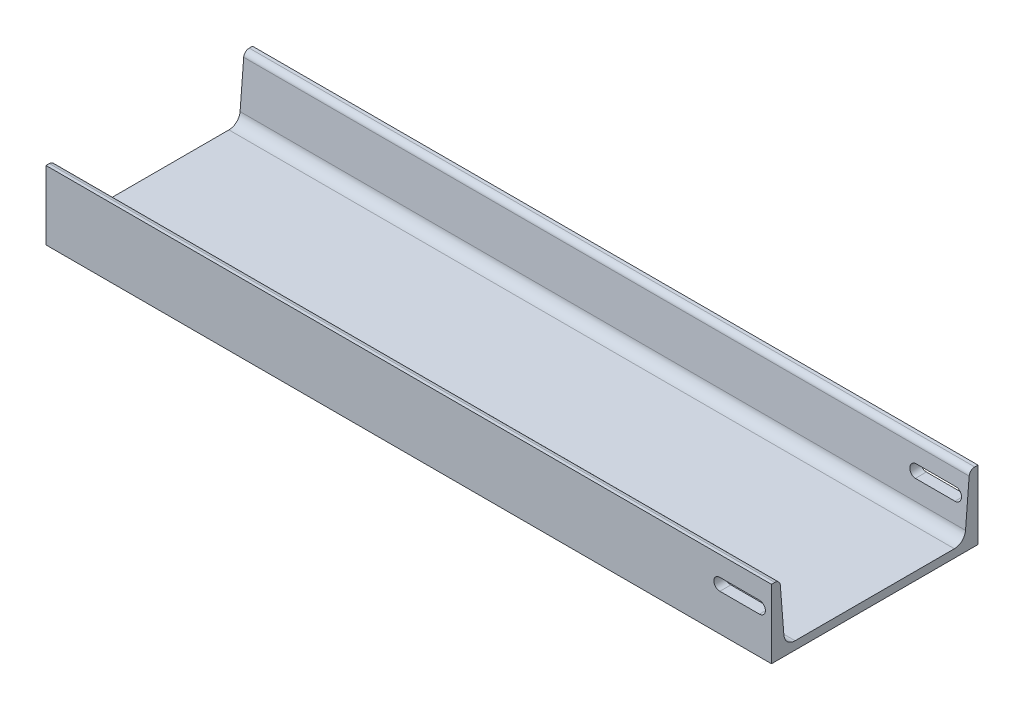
ISO-10303-21;
HEADER;
FILE_DESCRIPTION(('STEP AP214'),'2;1');
FILE_NAME('part.step','',(''),(''),'','','');
FILE_SCHEMA(('AUTOMOTIVE_DESIGN { 1 0 10303 214 1 1 1 1 }'));
ENDSEC;
DATA;
#1=APPLICATION_CONTEXT('core data for automotive mechanical design processes');
#2=APPLICATION_PROTOCOL_DEFINITION('international standard','automotive_design',2000,#1);
#3=PRODUCT_CONTEXT('',#1,'mechanical');
#4=PRODUCT('Part','Part','',(#3));
#5=PRODUCT_RELATED_PRODUCT_CATEGORY('part','',(#4));
#6=PRODUCT_DEFINITION_FORMATION('','',#4);
#7=PRODUCT_DEFINITION_CONTEXT('part definition',#1,'design');
#8=PRODUCT_DEFINITION('design','',#6,#7);
#9=PRODUCT_DEFINITION_SHAPE('','',#8);
#10=(LENGTH_UNIT() NAMED_UNIT(*) SI_UNIT(.MILLI.,.METRE.));
#11=(NAMED_UNIT(*) PLANE_ANGLE_UNIT() SI_UNIT($,.RADIAN.));
#12=(NAMED_UNIT(*) SI_UNIT($,.STERADIAN.) SOLID_ANGLE_UNIT());
#13=UNCERTAINTY_MEASURE_WITH_UNIT(LENGTH_MEASURE(1.E-05),#10,'distance_accuracy_value','');
#14=(GEOMETRIC_REPRESENTATION_CONTEXT(3) GLOBAL_UNCERTAINTY_ASSIGNED_CONTEXT((#13)) GLOBAL_UNIT_ASSIGNED_CONTEXT((#10,
#11,#12)) REPRESENTATION_CONTEXT('',''));
#15=CARTESIAN_POINT('',(0.,0.,0.));
#16=DIRECTION('',(0.,0.,1.));
#17=DIRECTION('',(1.,0.,0.));
#18=AXIS2_PLACEMENT_3D('',#15,#16,#17);
#19=CARTESIAN_POINT('',(842.999999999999,-2.22044604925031E-13,-119.999999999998));
#20=DIRECTION('',(0.,0.,1.));
#21=DIRECTION('',(0.,-1.,0.));
#22=AXIS2_PLACEMENT_3D('',#19,#20,#21);
#23=PLANE('',#22);
#24=DIRECTION('',(-1.,0.,0.));
#25=VECTOR('',#24,1.);
#26=CARTESIAN_POINT('',(782.999999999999,57.,-119.999999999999));
#27=LINE('',#26,#25);
#28=CARTESIAN_POINT('',(829.,57.0000000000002,-119.999999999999));
#29=VERTEX_POINT('',#28);
#30=CARTESIAN_POINT('',(782.999999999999,57.,-119.999999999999));
#31=VERTEX_POINT('',#30);
#32=EDGE_CURVE('E205',#29,#31,#27,.T.);
#33=ORIENTED_EDGE('',*,*,#32,.T.);
#34=CARTESIAN_POINT('',(782.999999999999,49.9999999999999,-119.999999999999));
#35=DIRECTION('',(0.,0.,1.));
#36=DIRECTION('',(1.,0.,0.));
#37=AXIS2_PLACEMENT_3D('',#34,#35,#36);
#38=CIRCLE('',#37,7.00000000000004);
#39=CARTESIAN_POINT('',(783.,42.9999999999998,-119.999999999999));
#40=VERTEX_POINT('',#39);
#41=EDGE_CURVE('E195',#31,#40,#38,.T.);
#42=ORIENTED_EDGE('',*,*,#41,.T.);
#43=DIRECTION('',(1.,0.,0.));
#44=VECTOR('',#43,1.);
#45=CARTESIAN_POINT('',(783.,42.9999999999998,-119.999999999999));
#46=LINE('',#45,#44);
#47=CARTESIAN_POINT('',(828.999999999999,42.9999999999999,-119.999999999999));
#48=VERTEX_POINT('',#47);
#49=EDGE_CURVE('E201',#40,#48,#46,.T.);
#50=ORIENTED_EDGE('',*,*,#49,.T.);
#51=CARTESIAN_POINT('',(829.,50.,-119.999999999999));
#52=DIRECTION('',(0.,0.,1.));
#53=DIRECTION('',(1.,0.,0.));
#54=AXIS2_PLACEMENT_3D('',#51,#52,#53);
#55=CIRCLE('',#54,7.00000000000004);
#56=EDGE_CURVE('E44',#48,#29,#55,.T.);
#57=ORIENTED_EDGE('',*,*,#56,.T.);
#58=EDGE_LOOP('',(#33,#42,#50,#57));
#59=FACE_BOUND('',#58,.T.);
#60=DIRECTION('',(0.,1.,0.));
#61=VECTOR('',#60,1.);
#62=CARTESIAN_POINT('',(-2.22044604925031E-13,-3.33066907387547E-13,-120.));
#63=LINE('',#62,#61);
#64=CARTESIAN_POINT('',(-2.22044604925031E-13,-3.33066907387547E-13,-120.));
#65=VERTEX_POINT('',#64);
#66=CARTESIAN_POINT('',(-4.44089209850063E-13,79.9999999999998,-120.));
#67=VERTEX_POINT('',#66);
#68=EDGE_CURVE('E238',#65,#67,#63,.T.);
#69=ORIENTED_EDGE('',*,*,#68,.T.);
#70=DIRECTION('',(-1.,0.,0.));
#71=VECTOR('',#70,1.);
#72=CARTESIAN_POINT('',(842.999999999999,79.9999999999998,-119.999999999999));
#73=LINE('',#72,#71);
#74=CARTESIAN_POINT('',(842.999999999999,79.9999999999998,-119.999999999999));
#75=VERTEX_POINT('',#74);
#76=EDGE_CURVE('E11',#75,#67,#73,.T.);
#77=ORIENTED_EDGE('',*,*,#76,.F.);
#78=DIRECTION('',(0.,1.,0.));
#79=VECTOR('',#78,1.);
#80=CARTESIAN_POINT('',(842.999999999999,-2.22044604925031E-13,-119.999999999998));
#81=LINE('',#80,#79);
#82=CARTESIAN_POINT('',(842.999999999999,-2.22044604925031E-13,-119.999999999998));
#83=VERTEX_POINT('',#82);
#84=EDGE_CURVE('E263',#83,#75,#81,.T.);
#85=ORIENTED_EDGE('',*,*,#84,.F.);
#86=DIRECTION('',(-1.,0.,0.));
#87=VECTOR('',#86,1.);
#88=CARTESIAN_POINT('',(842.999999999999,-2.22044604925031E-13,-119.999999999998));
#89=LINE('',#88,#87);
#90=EDGE_CURVE('E288',#83,#65,#89,.T.);
#91=ORIENTED_EDGE('',*,*,#90,.T.);
#92=EDGE_LOOP('',(#69,#77,#85,#91));
#93=FACE_BOUND('',#92,.T.);
#94=ADVANCED_FACE('F30',(#59,#93),#23,.F.);
#95=CARTESIAN_POINT('',(842.999999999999,79.9999999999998,-119.999999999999));
#96=DIRECTION('',(0.,-1.,0.));
#97=DIRECTION('',(0.,0.,-1.));
#98=AXIS2_PLACEMENT_3D('',#95,#96,#97);
#99=PLANE('',#98);
#100=DIRECTION('',(0.,0.,0.999999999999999));
#101=VECTOR('',#100,1.);
#102=CARTESIAN_POINT('',(-4.44089209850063E-13,79.9999999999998,-120.));
#103=LINE('',#102,#101);
#104=CARTESIAN_POINT('',(-4.44089209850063E-13,79.9999999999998,-116.198423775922));
#105=VERTEX_POINT('',#104);
#106=EDGE_CURVE('E241',#67,#105,#103,.T.);
#107=ORIENTED_EDGE('',*,*,#106,.T.);
#108=DIRECTION('',(-1.,0.,0.));
#109=VECTOR('',#108,1.);
#110=CARTESIAN_POINT('',(842.999999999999,80.,-116.198423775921));
#111=LINE('',#110,#109);
#112=CARTESIAN_POINT('',(842.999999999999,80.,-116.198423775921));
#113=VERTEX_POINT('',#112);
#114=EDGE_CURVE('E37',#113,#105,#111,.T.);
#115=ORIENTED_EDGE('',*,*,#114,.F.);
#116=DIRECTION('',(0.,0.,0.999999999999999));
#117=VECTOR('',#116,1.);
#118=CARTESIAN_POINT('',(842.999999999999,79.9999999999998,-119.999999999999));
#119=LINE('',#118,#117);
#120=EDGE_CURVE('E266',#75,#113,#119,.T.);
#121=ORIENTED_EDGE('',*,*,#120,.F.);
#122=ORIENTED_EDGE('',*,*,#76,.T.);
#123=EDGE_LOOP('',(#107,#115,#121,#122));
#124=FACE_BOUND('',#123,.T.);
#125=ADVANCED_FACE('F345',(#124),#99,.F.);
#126=CARTESIAN_POINT('',(843.,73.5000000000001,-116.198423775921));
#127=DIRECTION('',(-1.,0.,0.));
#128=DIRECTION('',(0.,0.,1.));
#129=AXIS2_PLACEMENT_3D('',#126,#127,#128);
#130=CYLINDRICAL_SURFACE('',#129,6.50000000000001);
#131=CARTESIAN_POINT('',(-2.22044604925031E-13,73.4999999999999,-116.198423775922));
#132=DIRECTION('',(1.,0.,0.));
#133=DIRECTION('',(0.,0.,-1.));
#134=AXIS2_PLACEMENT_3D('',#131,#132,#133);
#135=CIRCLE('',#134,6.50000000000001);
#136=CARTESIAN_POINT('',(-2.22044604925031E-13,74.0179005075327,-109.719089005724));
#137=VERTEX_POINT('',#136);
#138=EDGE_CURVE('E243',#105,#137,#135,.T.);
#139=ORIENTED_EDGE('',*,*,#138,.T.);
#140=DIRECTION('',(-1.,0.,0.));
#141=VECTOR('',#140,1.);
#142=CARTESIAN_POINT('',(843.,74.017900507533,-109.719089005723));
#143=LINE('',#142,#141);
#144=CARTESIAN_POINT('',(843.,74.017900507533,-109.719089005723));
#145=VERTEX_POINT('',#144);
#146=EDGE_CURVE('E315',#145,#137,#143,.T.);
#147=ORIENTED_EDGE('',*,*,#146,.F.);
#148=CARTESIAN_POINT('',(843.,73.5000000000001,-116.198423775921));
#149=DIRECTION('',(1.,0.,0.));
#150=DIRECTION('',(0.,0.,-1.));
#151=AXIS2_PLACEMENT_3D('',#148,#149,#150);
#152=CIRCLE('',#151,6.50000000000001);
#153=EDGE_CURVE('E268',#113,#145,#152,.T.);
#154=ORIENTED_EDGE('',*,*,#153,.F.);
#155=ORIENTED_EDGE('',*,*,#114,.T.);
#156=EDGE_LOOP('',(#139,#147,#154,#155));
#157=FACE_BOUND('',#156,.T.);
#158=ADVANCED_FACE('F322',(#157),#130,.T.);
#159=CARTESIAN_POINT('',(843.,74.017900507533,-109.719089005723));
#160=DIRECTION('',(0.,-0.0796770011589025,-0.99682073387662));
#161=DIRECTION('',(0.,0.99682073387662,-0.079677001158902));
#162=AXIS2_PLACEMENT_3D('',#159,#160,#161);
#163=PLANE('',#162);
#164=DIRECTION('',(-1.,0.,0.));
#165=VECTOR('',#164,1.);
#166=CARTESIAN_POINT('',(843.,42.9999999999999,-107.239793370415));
#167=LINE('',#166,#165);
#168=CARTESIAN_POINT('',(829.,42.9999999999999,-107.239793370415));
#169=VERTEX_POINT('',#168);
#170=CARTESIAN_POINT('',(783.,42.9999999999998,-107.239793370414));
#171=VERTEX_POINT('',#170);
#172=EDGE_CURVE('E219',#169,#171,#167,.T.);
#173=ORIENTED_EDGE('',*,*,#172,.T.);
#174=CARTESIAN_POINT('',(783.,50.0000000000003,-107.799311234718));
#175=DIRECTION('',(0.,-0.0796770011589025,-0.99682073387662));
#176=DIRECTION('',(0.,-0.99682073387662,0.079677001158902));
#177=AXIS2_PLACEMENT_3D('',#174,#175,#176);
#178=ELLIPSE('',#177,7.02232584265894,7.00000000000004);
#179=CARTESIAN_POINT('',(783.,56.9999999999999,-108.358829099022));
#180=VERTEX_POINT('',#179);
#181=EDGE_CURVE('E235',#171,#180,#178,.T.);
#182=ORIENTED_EDGE('',*,*,#181,.T.);
#183=DIRECTION('',(1.,0.,0.));
#184=VECTOR('',#183,1.);
#185=CARTESIAN_POINT('',(843.,57.,-108.358829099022));
#186=LINE('',#185,#184);
#187=CARTESIAN_POINT('',(829.,57.,-108.358829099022));
#188=VERTEX_POINT('',#187);
#189=EDGE_CURVE('E229',#180,#188,#186,.T.);
#190=ORIENTED_EDGE('',*,*,#189,.T.);
#191=CARTESIAN_POINT('',(829.,49.9999999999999,-107.799311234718));
#192=DIRECTION('',(0.,-0.0796770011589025,-0.99682073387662));
#193=DIRECTION('',(0.,-0.99682073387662,0.079677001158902));
#194=AXIS2_PLACEMENT_3D('',#191,#192,#193);
#195=ELLIPSE('',#194,7.02232584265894,7.00000000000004);
#196=EDGE_CURVE('E223',#188,#169,#195,.T.);
#197=ORIENTED_EDGE('',*,*,#196,.T.);
#198=EDGE_LOOP('',(#173,#182,#190,#197));
#199=FACE_BOUND('',#198,.T.);
#200=DIRECTION('',(0.,-0.99682073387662,0.0796770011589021));
#201=VECTOR('',#200,1.);
#202=CARTESIAN_POINT('',(-2.22044604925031E-13,74.0179005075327,-109.719089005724));
#203=LINE('',#202,#201);
#204=CARTESIAN_POINT('',(-2.22044604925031E-13,21.464198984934,-105.518412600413));
#205=VERTEX_POINT('',#204);
#206=EDGE_CURVE('E245',#137,#205,#203,.T.);
#207=ORIENTED_EDGE('',*,*,#206,.T.);
#208=DIRECTION('',(-1.,0.,0.));
#209=VECTOR('',#208,1.);
#210=CARTESIAN_POINT('',(843.,21.4641989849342,-105.518412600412));
#211=LINE('',#210,#209);
#212=CARTESIAN_POINT('',(843.,21.4641989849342,-105.518412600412));
#213=VERTEX_POINT('',#212);
#214=EDGE_CURVE('E312',#213,#205,#211,.T.);
#215=ORIENTED_EDGE('',*,*,#214,.F.);
#216=DIRECTION('',(0.,-0.99682073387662,0.0796770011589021));
#217=VECTOR('',#216,1.);
#218=CARTESIAN_POINT('',(843.,74.017900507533,-109.719089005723));
#219=LINE('',#218,#217);
#220=EDGE_CURVE('E270',#145,#213,#219,.T.);
#221=ORIENTED_EDGE('',*,*,#220,.F.);
#222=ORIENTED_EDGE('',*,*,#146,.T.);
#223=EDGE_LOOP('',(#207,#215,#221,#222));
#224=FACE_BOUND('',#223,.T.);
#225=ADVANCED_FACE('F333',(#199,#224),#163,.F.);
#226=CARTESIAN_POINT('',(843.,22.5000000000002,-92.5597430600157));
#227=DIRECTION('',(-1.,0.,0.));
#228=DIRECTION('',(0.,0.,1.));
#229=AXIS2_PLACEMENT_3D('',#226,#227,#228);
#230=CYLINDRICAL_SURFACE('',#229,13.);
#231=CARTESIAN_POINT('',(-3.33066907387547E-13,22.5,-92.5597430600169));
#232=DIRECTION('',(-1.,0.,0.));
#233=DIRECTION('',(0.,0.,1.));
#234=AXIS2_PLACEMENT_3D('',#231,#232,#233);
#235=CIRCLE('',#234,13.);
#236=CARTESIAN_POINT('',(-2.22044604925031E-13,9.49999999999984,-92.559743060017));
#237=VERTEX_POINT('',#236);
#238=EDGE_CURVE('E247',#205,#237,#235,.T.);
#239=ORIENTED_EDGE('',*,*,#238,.T.);
#240=DIRECTION('',(-1.,0.,0.));
#241=VECTOR('',#240,1.);
#242=CARTESIAN_POINT('',(843.,9.50000000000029,-92.5597430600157));
#243=LINE('',#242,#241);
#244=CARTESIAN_POINT('',(843.,9.50000000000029,-92.5597430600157));
#245=VERTEX_POINT('',#244);
#246=EDGE_CURVE('E309',#245,#237,#243,.T.);
#247=ORIENTED_EDGE('',*,*,#246,.F.);
#248=CARTESIAN_POINT('',(843.,22.5000000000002,-92.5597430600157));
#249=DIRECTION('',(-1.,0.,0.));
#250=DIRECTION('',(0.,0.,1.));
#251=AXIS2_PLACEMENT_3D('',#248,#249,#250);
#252=CIRCLE('',#251,13.);
#253=EDGE_CURVE('E272',#213,#245,#252,.T.);
#254=ORIENTED_EDGE('',*,*,#253,.F.);
#255=ORIENTED_EDGE('',*,*,#214,.T.);
#256=EDGE_LOOP('',(#239,#247,#254,#255));
#257=FACE_BOUND('',#256,.T.);
#258=ADVANCED_FACE('F337',(#257),#230,.F.);
#259=CARTESIAN_POINT('',(843.,9.50000000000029,-92.5597430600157));
#260=DIRECTION('',(0.,-1.,0.));
#261=DIRECTION('',(0.,0.,-1.));
#262=AXIS2_PLACEMENT_3D('',#259,#260,#261);
#263=PLANE('',#262);
#264=DIRECTION('',(0.,0.,1.));
#265=VECTOR('',#264,1.);
#266=CARTESIAN_POINT('',(-2.22044604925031E-13,9.49999999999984,-92.559743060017));
#267=LINE('',#266,#265);
#268=CARTESIAN_POINT('',(2.22044604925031E-13,9.50000000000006,92.559743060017));
#269=VERTEX_POINT('',#268);
#270=EDGE_CURVE('E249',#237,#269,#267,.T.);
#271=ORIENTED_EDGE('',*,*,#270,.T.);
#272=DIRECTION('',(-1.,0.,0.));
#273=VECTOR('',#272,1.);
#274=CARTESIAN_POINT('',(843.,9.5000000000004,92.5597430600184));
#275=LINE('',#274,#273);
#276=CARTESIAN_POINT('',(843.,9.5000000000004,92.5597430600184));
#277=VERTEX_POINT('',#276);
#278=EDGE_CURVE('E306',#277,#269,#275,.T.);
#279=ORIENTED_EDGE('',*,*,#278,.F.);
#280=DIRECTION('',(0.,0.,1.));
#281=VECTOR('',#280,1.);
#282=CARTESIAN_POINT('',(843.,9.50000000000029,-92.5597430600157));
#283=LINE('',#282,#281);
#284=EDGE_CURVE('E274',#245,#277,#283,.T.);
#285=ORIENTED_EDGE('',*,*,#284,.F.);
#286=ORIENTED_EDGE('',*,*,#246,.T.);
#287=EDGE_LOOP('',(#271,#279,#285,#286));
#288=FACE_BOUND('',#287,.T.);
#289=ADVANCED_FACE('F376',(#288),#263,.F.);
#290=CARTESIAN_POINT('',(843.,22.5000000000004,92.5597430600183));
#291=DIRECTION('',(-1.,0.,0.));
#292=DIRECTION('',(0.,0.,1.));
#293=AXIS2_PLACEMENT_3D('',#290,#291,#292);
#294=CYLINDRICAL_SURFACE('',#293,13.);
#295=CARTESIAN_POINT('',(2.22044604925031E-13,22.5000000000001,92.5597430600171));
#296=DIRECTION('',(-1.,0.,0.));
#297=DIRECTION('',(0.,0.,-1.));
#298=AXIS2_PLACEMENT_3D('',#295,#296,#297);
#299=CIRCLE('',#298,13.);
#300=CARTESIAN_POINT('',(2.22044604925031E-13,21.4641989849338,105.518412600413));
#301=VERTEX_POINT('',#300);
#302=EDGE_CURVE('E251',#269,#301,#299,.T.);
#303=ORIENTED_EDGE('',*,*,#302,.T.);
#304=DIRECTION('',(-1.,0.,0.));
#305=VECTOR('',#304,1.);
#306=CARTESIAN_POINT('',(843.,21.4641989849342,105.518412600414));
#307=LINE('',#306,#305);
#308=CARTESIAN_POINT('',(843.,21.4641989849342,105.518412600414));
#309=VERTEX_POINT('',#308);
#310=EDGE_CURVE('E303',#309,#301,#307,.T.);
#311=ORIENTED_EDGE('',*,*,#310,.F.);
#312=CARTESIAN_POINT('',(843.,22.5000000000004,92.5597430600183));
#313=DIRECTION('',(-1.,0.,0.));
#314=DIRECTION('',(0.,0.,-1.));
#315=AXIS2_PLACEMENT_3D('',#312,#313,#314);
#316=CIRCLE('',#315,13.);
#317=EDGE_CURVE('E276',#277,#309,#316,.T.);
#318=ORIENTED_EDGE('',*,*,#317,.F.);
#319=ORIENTED_EDGE('',*,*,#278,.T.);
#320=EDGE_LOOP('',(#303,#311,#318,#319));
#321=FACE_BOUND('',#320,.T.);
#322=ADVANCED_FACE('F374',(#321),#294,.F.);
#323=CARTESIAN_POINT('',(843.,74.0179005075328,109.719089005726));
#324=DIRECTION('',(0.,-0.0796770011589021,0.99682073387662));
#325=DIRECTION('',(0.,-0.99682073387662,-0.0796770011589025));
#326=AXIS2_PLACEMENT_3D('',#323,#324,#325);
#327=PLANE('',#326);
#328=DIRECTION('',(-1.,0.,0.));
#329=VECTOR('',#328,1.);
#330=CARTESIAN_POINT('',(843.,57.,108.358829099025));
#331=LINE('',#330,#329);
#332=CARTESIAN_POINT('',(829.,56.9999999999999,108.358829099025));
#333=VERTEX_POINT('',#332);
#334=CARTESIAN_POINT('',(783.,56.9999999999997,108.358829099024));
#335=VERTEX_POINT('',#334);
#336=EDGE_CURVE('E226',#333,#335,#331,.T.);
#337=ORIENTED_EDGE('',*,*,#336,.T.);
#338=CARTESIAN_POINT('',(783.,50.,107.799311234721));
#339=DIRECTION('',(0.,-0.0796770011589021,0.99682073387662));
#340=DIRECTION('',(0.,0.99682073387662,0.0796770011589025));
#341=AXIS2_PLACEMENT_3D('',#338,#339,#340);
#342=ELLIPSE('',#341,7.02232584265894,7.00000000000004);
#343=CARTESIAN_POINT('',(783.,42.9999999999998,107.239793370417));
#344=VERTEX_POINT('',#343);
#345=EDGE_CURVE('E232',#335,#344,#342,.T.);
#346=ORIENTED_EDGE('',*,*,#345,.T.);
#347=DIRECTION('',(1.,0.,0.));
#348=VECTOR('',#347,1.);
#349=CARTESIAN_POINT('',(843.,43.,107.239793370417));
#350=LINE('',#349,#348);
#351=CARTESIAN_POINT('',(829.,42.9999999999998,107.239793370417));
#352=VERTEX_POINT('',#351);
#353=EDGE_CURVE('E211',#344,#352,#350,.T.);
#354=ORIENTED_EDGE('',*,*,#353,.T.);
#355=CARTESIAN_POINT('',(829.,49.9999999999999,107.799311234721));
#356=DIRECTION('',(0.,-0.0796770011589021,0.99682073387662));
#357=DIRECTION('',(0.,0.99682073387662,0.0796770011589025));
#358=AXIS2_PLACEMENT_3D('',#355,#356,#357);
#359=ELLIPSE('',#358,7.02232584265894,7.00000000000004);
#360=EDGE_CURVE('E175',#352,#333,#359,.T.);
#361=ORIENTED_EDGE('',*,*,#360,.T.);
#362=EDGE_LOOP('',(#337,#346,#354,#361));
#363=FACE_BOUND('',#362,.T.);
#364=DIRECTION('',(0.,0.99682073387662,0.0796770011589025));
#365=VECTOR('',#364,1.);
#366=CARTESIAN_POINT('',(3.33066907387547E-13,74.0179005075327,109.719089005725));
#367=LINE('',#366,#365);
#368=CARTESIAN_POINT('',(3.33066907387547E-13,74.0179005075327,109.719089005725));
#369=VERTEX_POINT('',#368);
#370=EDGE_CURVE('E253',#301,#369,#367,.T.);
#371=ORIENTED_EDGE('',*,*,#370,.T.);
#372=DIRECTION('',(-1.,0.,0.));
#373=VECTOR('',#372,1.);
#374=CARTESIAN_POINT('',(843.,74.0179005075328,109.719089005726));
#375=LINE('',#374,#373);
#376=CARTESIAN_POINT('',(843.,74.0179005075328,109.719089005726));
#377=VERTEX_POINT('',#376);
#378=EDGE_CURVE('E300',#377,#369,#375,.T.);
#379=ORIENTED_EDGE('',*,*,#378,.F.);
#380=DIRECTION('',(0.,0.99682073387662,0.0796770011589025));
#381=VECTOR('',#380,1.);
#382=CARTESIAN_POINT('',(843.,74.0179005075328,109.719089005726));
#383=LINE('',#382,#381);
#384=EDGE_CURVE('E278',#309,#377,#383,.T.);
#385=ORIENTED_EDGE('',*,*,#384,.F.);
#386=ORIENTED_EDGE('',*,*,#310,.T.);
#387=EDGE_LOOP('',(#371,#379,#385,#386));
#388=FACE_BOUND('',#387,.T.);
#389=ADVANCED_FACE('F370',(#363,#388),#327,.F.);
#390=CARTESIAN_POINT('',(843.,73.5000000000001,116.198423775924));
#391=DIRECTION('',(-1.,0.,0.));
#392=DIRECTION('',(0.,0.,1.));
#393=AXIS2_PLACEMENT_3D('',#390,#391,#392);
#394=CYLINDRICAL_SURFACE('',#393,6.50000000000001);
#395=CARTESIAN_POINT('',(3.33066907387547E-13,73.4999999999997,116.198423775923));
#396=DIRECTION('',(1.,0.,0.));
#397=DIRECTION('',(0.,0.,1.));
#398=AXIS2_PLACEMENT_3D('',#395,#396,#397);
#399=CIRCLE('',#398,6.50000000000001);
#400=CARTESIAN_POINT('',(2.22044604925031E-13,79.9999999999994,116.198423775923));
#401=VERTEX_POINT('',#400);
#402=EDGE_CURVE('E255',#369,#401,#399,.T.);
#403=ORIENTED_EDGE('',*,*,#402,.T.);
#404=DIRECTION('',(-1.,0.,0.));
#405=VECTOR('',#404,1.);
#406=CARTESIAN_POINT('',(843.,80.0000000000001,116.198423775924));
#407=LINE('',#406,#405);
#408=CARTESIAN_POINT('',(843.,80.0000000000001,116.198423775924));
#409=VERTEX_POINT('',#408);
#410=EDGE_CURVE('E297',#409,#401,#407,.T.);
#411=ORIENTED_EDGE('',*,*,#410,.F.);
#412=CARTESIAN_POINT('',(843.,73.5000000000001,116.198423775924));
#413=DIRECTION('',(1.,0.,0.));
#414=DIRECTION('',(0.,0.,1.));
#415=AXIS2_PLACEMENT_3D('',#412,#413,#414);
#416=CIRCLE('',#415,6.50000000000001);
#417=EDGE_CURVE('E280',#377,#409,#416,.T.);
#418=ORIENTED_EDGE('',*,*,#417,.F.);
#419=ORIENTED_EDGE('',*,*,#378,.T.);
#420=EDGE_LOOP('',(#403,#411,#418,#419));
#421=FACE_BOUND('',#420,.T.);
#422=ADVANCED_FACE('F365',(#421),#394,.T.);
#423=CARTESIAN_POINT('',(843.,80.,120.000000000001));
#424=DIRECTION('',(0.,-1.,0.));
#425=DIRECTION('',(0.,0.,-1.));
#426=AXIS2_PLACEMENT_3D('',#423,#424,#425);
#427=PLANE('',#426);
#428=DIRECTION('',(0.,0.,0.999999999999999));
#429=VECTOR('',#428,1.);
#430=CARTESIAN_POINT('',(2.22044604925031E-13,79.9999999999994,120.));
#431=LINE('',#430,#429);
#432=CARTESIAN_POINT('',(2.22044604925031E-13,79.9999999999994,120.));
#433=VERTEX_POINT('',#432);
#434=EDGE_CURVE('E257',#401,#433,#431,.T.);
#435=ORIENTED_EDGE('',*,*,#434,.T.);
#436=DIRECTION('',(-1.,0.,0.));
#437=VECTOR('',#436,1.);
#438=CARTESIAN_POINT('',(843.,80.,120.000000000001));
#439=LINE('',#438,#437);
#440=CARTESIAN_POINT('',(843.,80.,120.000000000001));
#441=VERTEX_POINT('',#440);
#442=EDGE_CURVE('E294',#441,#433,#439,.T.);
#443=ORIENTED_EDGE('',*,*,#442,.F.);
#444=DIRECTION('',(0.,0.,0.999999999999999));
#445=VECTOR('',#444,1.);
#446=CARTESIAN_POINT('',(843.,80.,120.000000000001));
#447=LINE('',#446,#445);
#448=EDGE_CURVE('E282',#409,#441,#447,.T.);
#449=ORIENTED_EDGE('',*,*,#448,.F.);
#450=ORIENTED_EDGE('',*,*,#410,.T.);
#451=EDGE_LOOP('',(#435,#443,#449,#450));
#452=FACE_BOUND('',#451,.T.);
#453=ADVANCED_FACE('F359',(#452),#427,.F.);
#454=CARTESIAN_POINT('',(843.,0.,120.000000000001));
#455=DIRECTION('',(0.,0.,-1.));
#456=DIRECTION('',(0.,1.,0.));
#457=AXIS2_PLACEMENT_3D('',#454,#455,#456);
#458=PLANE('',#457);
#459=DIRECTION('',(1.,0.,0.));
#460=VECTOR('',#459,1.);
#461=CARTESIAN_POINT('',(783.,42.9999999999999,120.000000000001));
#462=LINE('',#461,#460);
#463=CARTESIAN_POINT('',(783.,42.9999999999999,120.000000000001));
#464=VERTEX_POINT('',#463);
#465=CARTESIAN_POINT('',(829.,42.9999999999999,120.000000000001));
#466=VERTEX_POINT('',#465);
#467=EDGE_CURVE('E182',#464,#466,#462,.T.);
#468=ORIENTED_EDGE('',*,*,#467,.F.);
#469=CARTESIAN_POINT('',(783.,49.9999999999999,120.000000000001));
#470=DIRECTION('',(0.,0.,1.));
#471=DIRECTION('',(1.,0.,0.));
#472=AXIS2_PLACEMENT_3D('',#469,#470,#471);
#473=CIRCLE('',#472,7.00000000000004);
#474=CARTESIAN_POINT('',(783.,57.0000000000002,120.000000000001));
#475=VERTEX_POINT('',#474);
#476=EDGE_CURVE('E188',#475,#464,#473,.T.);
#477=ORIENTED_EDGE('',*,*,#476,.F.);
#478=DIRECTION('',(-1.,0.,0.));
#479=VECTOR('',#478,1.);
#480=CARTESIAN_POINT('',(783.,57.0000000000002,120.000000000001));
#481=LINE('',#480,#479);
#482=CARTESIAN_POINT('',(829.,57.,120.000000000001));
#483=VERTEX_POINT('',#482);
#484=EDGE_CURVE('E193',#483,#475,#481,.T.);
#485=ORIENTED_EDGE('',*,*,#484,.F.);
#486=CARTESIAN_POINT('',(829.,50.,120.000000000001));
#487=DIRECTION('',(0.,0.,1.));
#488=DIRECTION('',(1.,0.,0.));
#489=AXIS2_PLACEMENT_3D('',#486,#487,#488);
#490=CIRCLE('',#489,7.00000000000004);
#491=EDGE_CURVE('E172',#466,#483,#490,.T.);
#492=ORIENTED_EDGE('',*,*,#491,.F.);
#493=EDGE_LOOP('',(#468,#477,#485,#492));
#494=FACE_BOUND('',#493,.T.);
#495=DIRECTION('',(0.,-1.,0.));
#496=VECTOR('',#495,1.);
#497=CARTESIAN_POINT('',(1.11022302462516E-13,-5.55111512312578E-13,120.));
#498=LINE('',#497,#496);
#499=CARTESIAN_POINT('',(1.11022302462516E-13,-5.55111512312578E-13,120.));
#500=VERTEX_POINT('',#499);
#501=EDGE_CURVE('E259',#433,#500,#498,.T.);
#502=ORIENTED_EDGE('',*,*,#501,.T.);
#503=DIRECTION('',(-1.,0.,0.));
#504=VECTOR('',#503,1.);
#505=CARTESIAN_POINT('',(843.,0.,120.000000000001));
#506=LINE('',#505,#504);
#507=CARTESIAN_POINT('',(843.,0.,120.000000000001));
#508=VERTEX_POINT('',#507);
#509=EDGE_CURVE('E291',#508,#500,#506,.T.);
#510=ORIENTED_EDGE('',*,*,#509,.F.);
#511=DIRECTION('',(0.,-1.,0.));
#512=VECTOR('',#511,1.);
#513=CARTESIAN_POINT('',(843.,0.,120.000000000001));
#514=LINE('',#513,#512);
#515=EDGE_CURVE('E284',#441,#508,#514,.T.);
#516=ORIENTED_EDGE('',*,*,#515,.F.);
#517=ORIENTED_EDGE('',*,*,#442,.T.);
#518=EDGE_LOOP('',(#502,#510,#516,#517));
#519=FACE_BOUND('',#518,.T.);
#520=ADVANCED_FACE('F190',(#494,#519),#458,.F.);
#521=CARTESIAN_POINT('',(843.,0.,120.000000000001));
#522=DIRECTION('',(0.,1.,0.));
#523=DIRECTION('',(0.,0.,1.));
#524=AXIS2_PLACEMENT_3D('',#521,#522,#523);
#525=PLANE('',#524);
#526=DIRECTION('',(0.,0.,-1.));
#527=VECTOR('',#526,1.);
#528=CARTESIAN_POINT('',(1.11022302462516E-13,-5.55111512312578E-13,120.));
#529=LINE('',#528,#527);
#530=EDGE_CURVE('E261',#500,#65,#529,.T.);
#531=ORIENTED_EDGE('',*,*,#530,.T.);
#532=ORIENTED_EDGE('',*,*,#90,.F.);
#533=DIRECTION('',(0.,0.,-1.));
#534=VECTOR('',#533,1.);
#535=CARTESIAN_POINT('',(843.,0.,120.000000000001));
#536=LINE('',#535,#534);
#537=EDGE_CURVE('E286',#508,#83,#536,.T.);
#538=ORIENTED_EDGE('',*,*,#537,.F.);
#539=ORIENTED_EDGE('',*,*,#509,.T.);
#540=EDGE_LOOP('',(#531,#532,#538,#539));
#541=FACE_BOUND('',#540,.T.);
#542=ADVANCED_FACE('F352',(#541),#525,.F.);
#543=CARTESIAN_POINT('',(843.,73.5000000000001,-116.198423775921));
#544=DIRECTION('',(1.,0.,0.));
#545=DIRECTION('',(0.,0.,-1.));
#546=AXIS2_PLACEMENT_3D('',#543,#544,#545);
#547=PLANE('',#546);
#548=ORIENTED_EDGE('',*,*,#84,.T.);
#549=ORIENTED_EDGE('',*,*,#120,.T.);
#550=ORIENTED_EDGE('',*,*,#153,.T.);
#551=ORIENTED_EDGE('',*,*,#220,.T.);
#552=ORIENTED_EDGE('',*,*,#253,.T.);
#553=ORIENTED_EDGE('',*,*,#284,.T.);
#554=ORIENTED_EDGE('',*,*,#317,.T.);
#555=ORIENTED_EDGE('',*,*,#384,.T.);
#556=ORIENTED_EDGE('',*,*,#417,.T.);
#557=ORIENTED_EDGE('',*,*,#448,.T.);
#558=ORIENTED_EDGE('',*,*,#515,.T.);
#559=ORIENTED_EDGE('',*,*,#537,.T.);
#560=EDGE_LOOP('',(#548,#549,#550,#551,#552,#553,#554,#555,#556,#557,#558,#559));
#561=FACE_BOUND('',#560,.T.);
#562=ADVANCED_FACE('F341',(#561),#547,.T.);
#563=CARTESIAN_POINT('',(-2.22044604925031E-13,73.4999999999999,-116.198423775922));
#564=DIRECTION('',(1.,0.,0.));
#565=DIRECTION('',(0.,0.,-1.));
#566=AXIS2_PLACEMENT_3D('',#563,#564,#565);
#567=PLANE('',#566);
#568=ORIENTED_EDGE('',*,*,#68,.F.);
#569=ORIENTED_EDGE('',*,*,#530,.F.);
#570=ORIENTED_EDGE('',*,*,#501,.F.);
#571=ORIENTED_EDGE('',*,*,#434,.F.);
#572=ORIENTED_EDGE('',*,*,#402,.F.);
#573=ORIENTED_EDGE('',*,*,#370,.F.);
#574=ORIENTED_EDGE('',*,*,#302,.F.);
#575=ORIENTED_EDGE('',*,*,#270,.F.);
#576=ORIENTED_EDGE('',*,*,#238,.F.);
#577=ORIENTED_EDGE('',*,*,#206,.F.);
#578=ORIENTED_EDGE('',*,*,#138,.F.);
#579=ORIENTED_EDGE('',*,*,#106,.F.);
#580=EDGE_LOOP('',(#568,#569,#570,#571,#572,#573,#574,#575,#576,#577,#578,#579));
#581=FACE_BOUND('',#580,.T.);
#582=ADVANCED_FACE('F328',(#581),#567,.F.);
#583=CARTESIAN_POINT('',(783.,42.9999999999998,-119.999999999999));
#584=DIRECTION('',(0.,-1.,0.));
#585=DIRECTION('',(0.,0.,-1.));
#586=AXIS2_PLACEMENT_3D('',#583,#584,#585);
#587=PLANE('',#586);
#588=DIRECTION('',(0.,0.,1.));
#589=VECTOR('',#588,1.);
#590=CARTESIAN_POINT('',(783.,42.9999999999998,-119.999999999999));
#591=LINE('',#590,#589);
#592=EDGE_CURVE('E185',#344,#464,#591,.T.);
#593=ORIENTED_EDGE('',*,*,#592,.T.);
#594=ORIENTED_EDGE('',*,*,#467,.T.);
#595=DIRECTION('',(0.,0.,1.));
#596=VECTOR('',#595,1.);
#597=CARTESIAN_POINT('',(828.999999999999,42.9999999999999,-119.999999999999));
#598=LINE('',#597,#596);
#599=EDGE_CURVE('E167',#352,#466,#598,.T.);
#600=ORIENTED_EDGE('',*,*,#599,.F.);
#601=ORIENTED_EDGE('',*,*,#353,.F.);
#602=EDGE_LOOP('',(#593,#594,#600,#601));
#603=FACE_BOUND('',#602,.T.);
#604=ADVANCED_FACE('F183',(#603),#587,.F.);
#605=CARTESIAN_POINT('',(829.,50.,-119.999999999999));
#606=DIRECTION('',(0.,0.,1.));
#607=DIRECTION('',(1.,0.,0.));
#608=AXIS2_PLACEMENT_3D('',#605,#606,#607);
#609=CYLINDRICAL_SURFACE('',#608,7.00000000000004);
#610=ORIENTED_EDGE('',*,*,#599,.T.);
#611=ORIENTED_EDGE('',*,*,#491,.T.);
#612=DIRECTION('',(0.,0.,1.));
#613=VECTOR('',#612,1.);
#614=CARTESIAN_POINT('',(829.,57.0000000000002,-119.999999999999));
#615=LINE('',#614,#613);
#616=EDGE_CURVE('E215',#333,#483,#615,.T.);
#617=ORIENTED_EDGE('',*,*,#616,.F.);
#618=ORIENTED_EDGE('',*,*,#360,.F.);
#619=EDGE_LOOP('',(#610,#611,#617,#618));
#620=FACE_BOUND('',#619,.T.);
#621=ADVANCED_FACE('F169',(#620),#609,.F.);
#622=CARTESIAN_POINT('',(782.999999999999,57.,-119.999999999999));
#623=DIRECTION('',(0.,1.,0.));
#624=DIRECTION('',(0.,0.,1.));
#625=AXIS2_PLACEMENT_3D('',#622,#623,#624);
#626=PLANE('',#625);
#627=ORIENTED_EDGE('',*,*,#616,.T.);
#628=ORIENTED_EDGE('',*,*,#484,.T.);
#629=DIRECTION('',(0.,0.,1.));
#630=VECTOR('',#629,1.);
#631=CARTESIAN_POINT('',(782.999999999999,57.,-119.999999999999));
#632=LINE('',#631,#630);
#633=EDGE_CURVE('E212',#335,#475,#632,.T.);
#634=ORIENTED_EDGE('',*,*,#633,.F.);
#635=ORIENTED_EDGE('',*,*,#336,.F.);
#636=EDGE_LOOP('',(#627,#628,#634,#635));
#637=FACE_BOUND('',#636,.T.);
#638=ADVANCED_FACE('F481',(#637),#626,.F.);
#639=CARTESIAN_POINT('',(782.999999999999,49.9999999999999,-119.999999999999));
#640=DIRECTION('',(0.,0.,1.));
#641=DIRECTION('',(1.,0.,0.));
#642=AXIS2_PLACEMENT_3D('',#639,#640,#641);
#643=CYLINDRICAL_SURFACE('',#642,7.00000000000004);
#644=ORIENTED_EDGE('',*,*,#633,.T.);
#645=ORIENTED_EDGE('',*,*,#476,.T.);
#646=ORIENTED_EDGE('',*,*,#592,.F.);
#647=ORIENTED_EDGE('',*,*,#345,.F.);
#648=EDGE_LOOP('',(#644,#645,#646,#647));
#649=FACE_BOUND('',#648,.T.);
#650=ADVANCED_FACE('F488',(#649),#643,.F.);
#651=EDGE_CURVE('E52',#40,#171,#591,.T.);
#652=ORIENTED_EDGE('',*,*,#651,.F.);
#653=ORIENTED_EDGE('',*,*,#41,.F.);
#654=EDGE_CURVE('E208',#31,#180,#632,.T.);
#655=ORIENTED_EDGE('',*,*,#654,.T.);
#656=ORIENTED_EDGE('',*,*,#181,.F.);
#657=EDGE_LOOP('',(#652,#653,#655,#656));
#658=FACE_BOUND('',#657,.T.);
#659=ADVANCED_FACE('F395',(#658),#643,.F.);
#660=ORIENTED_EDGE('',*,*,#654,.F.);
#661=ORIENTED_EDGE('',*,*,#32,.F.);
#662=EDGE_CURVE('E213',#29,#188,#615,.T.);
#663=ORIENTED_EDGE('',*,*,#662,.T.);
#664=ORIENTED_EDGE('',*,*,#189,.F.);
#665=EDGE_LOOP('',(#660,#661,#663,#664));
#666=FACE_BOUND('',#665,.T.);
#667=ADVANCED_FACE('F393',(#666),#626,.F.);
#668=ORIENTED_EDGE('',*,*,#662,.F.);
#669=ORIENTED_EDGE('',*,*,#56,.F.);
#670=EDGE_CURVE('E178',#48,#169,#598,.T.);
#671=ORIENTED_EDGE('',*,*,#670,.T.);
#672=ORIENTED_EDGE('',*,*,#196,.F.);
#673=EDGE_LOOP('',(#668,#669,#671,#672));
#674=FACE_BOUND('',#673,.T.);
#675=ADVANCED_FACE('F397',(#674),#609,.F.);
#676=ORIENTED_EDGE('',*,*,#670,.F.);
#677=ORIENTED_EDGE('',*,*,#49,.F.);
#678=ORIENTED_EDGE('',*,*,#651,.T.);
#679=ORIENTED_EDGE('',*,*,#172,.F.);
#680=EDGE_LOOP('',(#676,#677,#678,#679));
#681=FACE_BOUND('',#680,.T.);
#682=ADVANCED_FACE('F396',(#681),#587,.F.);
#683=CLOSED_SHELL('',(#94,#125,#158,#225,#258,#289,#322,#389,#422,#453,#520,#542,#562,#582,#604,
#621,#638,#650,#659,#667,#675,#682));
#684=MANIFOLD_SOLID_BREP('B2',#683);
#685=ADVANCED_BREP_SHAPE_REPRESENTATION('',(#18,#684),#14);
#686=SHAPE_DEFINITION_REPRESENTATION(#9,#685);
ENDSEC;
END-ISO-10303-21;
